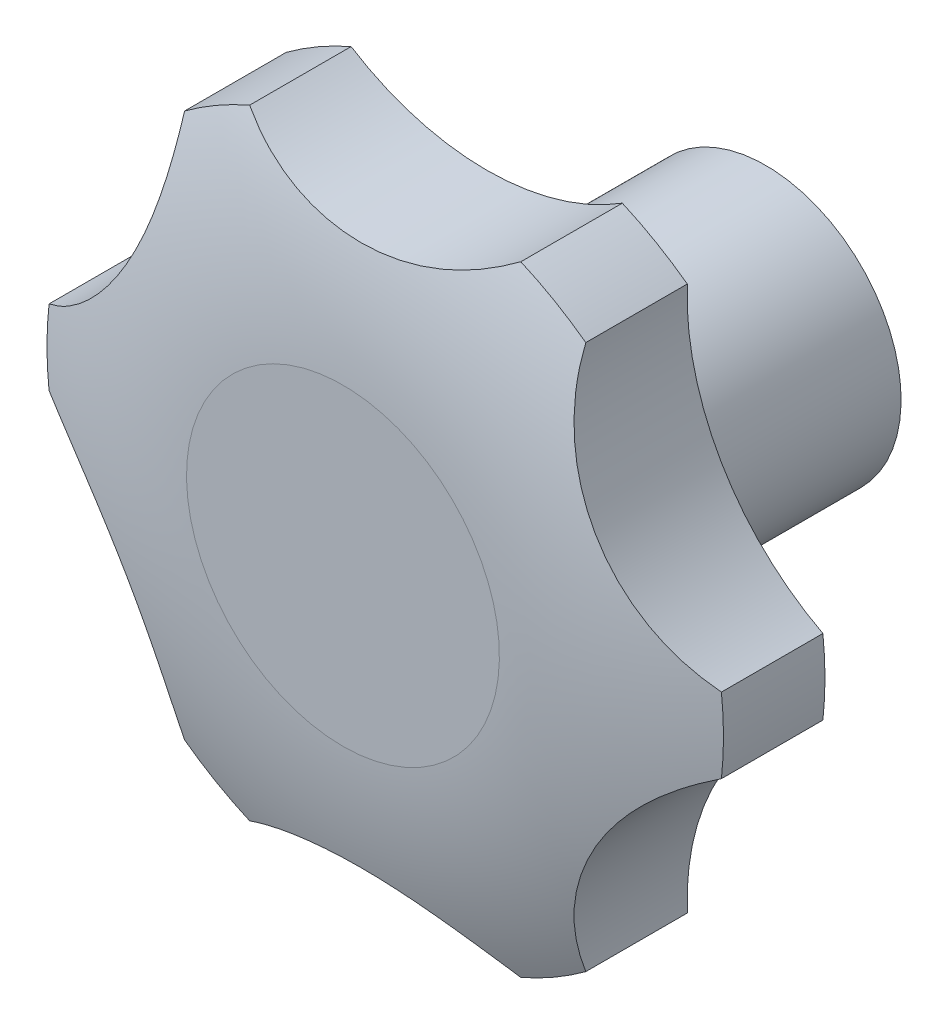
ISO-10303-21;
HEADER;
FILE_DESCRIPTION(('STEP AP214'),'2;1');
FILE_NAME('part.step','',(''),(''),'','','');
FILE_SCHEMA(('AUTOMOTIVE_DESIGN { 1 0 10303 214 1 1 1 1 }'));
ENDSEC;
DATA;
#1=APPLICATION_CONTEXT('core data for automotive mechanical design processes');
#2=APPLICATION_PROTOCOL_DEFINITION('international standard','automotive_design',2000,#1);
#3=PRODUCT_CONTEXT('',#1,'mechanical');
#4=PRODUCT('Part','Part','',(#3));
#5=PRODUCT_RELATED_PRODUCT_CATEGORY('part','',(#4));
#6=PRODUCT_DEFINITION_FORMATION('','',#4);
#7=PRODUCT_DEFINITION_CONTEXT('part definition',#1,'design');
#8=PRODUCT_DEFINITION('design','',#6,#7);
#9=PRODUCT_DEFINITION_SHAPE('','',#8);
#10=(LENGTH_UNIT() NAMED_UNIT(*) SI_UNIT(.MILLI.,.METRE.));
#11=(NAMED_UNIT(*) PLANE_ANGLE_UNIT() SI_UNIT($,.RADIAN.));
#12=(NAMED_UNIT(*) SI_UNIT($,.STERADIAN.) SOLID_ANGLE_UNIT());
#13=UNCERTAINTY_MEASURE_WITH_UNIT(LENGTH_MEASURE(1.E-05),#10,'distance_accuracy_value','');
#14=(GEOMETRIC_REPRESENTATION_CONTEXT(3) GLOBAL_UNCERTAINTY_ASSIGNED_CONTEXT((#13)) GLOBAL_UNIT_ASSIGNED_CONTEXT((#10,
#11,#12)) REPRESENTATION_CONTEXT('',''));
#15=CARTESIAN_POINT('',(0.,0.,0.));
#16=DIRECTION('',(0.,0.,1.));
#17=DIRECTION('',(1.,0.,0.));
#18=AXIS2_PLACEMENT_3D('',#15,#16,#17);
#19=CARTESIAN_POINT('',(0.,0.,0.));
#20=DIRECTION('',(0.,0.,1.));
#21=DIRECTION('',(0.,-1.,0.));
#22=AXIS2_PLACEMENT_3D('',#19,#20,#21);
#23=PLANE('',#22);
#24=CARTESIAN_POINT('',(0.,0.,0.));
#25=DIRECTION('',(0.,0.,-1.));
#26=DIRECTION('',(0.,1.,0.));
#27=AXIS2_PLACEMENT_3D('',#24,#25,#26);
#28=CIRCLE('',#27,2.5);
#29=CARTESIAN_POINT('',(0.,2.5,0.));
#30=VERTEX_POINT('',#29);
#31=EDGE_CURVE('E214',#30,#30,#28,.T.);
#32=ORIENTED_EDGE('',*,*,#31,.F.);
#33=EDGE_LOOP('',(#32));
#34=FACE_BOUND('',#33,.T.);
#35=CARTESIAN_POINT('',(0.,0.,0.));
#36=DIRECTION('',(0.,0.,1.));
#37=DIRECTION('',(0.,-1.,0.));
#38=AXIS2_PLACEMENT_3D('',#35,#36,#37);
#39=CIRCLE('',#38,16.);
#40=CARTESIAN_POINT('',(0.,-16.,0.));
#41=VERTEX_POINT('',#40);
#42=EDGE_CURVE('E158',#41,#41,#39,.T.);
#43=ORIENTED_EDGE('',*,*,#42,.F.);
#44=EDGE_LOOP('',(#43));
#45=FACE_BOUND('',#44,.T.);
#46=ADVANCED_FACE('F14',(#34,#45),#23,.F.);
#47=CARTESIAN_POINT('',(0.,0.,30.));
#48=DIRECTION('',(0.,0.,1.));
#49=DIRECTION('',(0.,-1.,0.));
#50=AXIS2_PLACEMENT_3D('',#47,#48,#49);
#51=CYLINDRICAL_SURFACE('',#50,16.);
#52=ORIENTED_EDGE('',*,*,#42,.T.);
#53=EDGE_LOOP('',(#52));
#54=FACE_BOUND('',#53,.T.);
#55=CARTESIAN_POINT('',(0.,0.,33.));
#56=DIRECTION('',(0.,0.,-1.));
#57=DIRECTION('',(-1.,0.,0.));
#58=AXIS2_PLACEMENT_3D('',#55,#56,#57);
#59=CIRCLE('',#58,16.);
#60=CARTESIAN_POINT('',(-16.,0.,33.));
#61=VERTEX_POINT('',#60);
#62=EDGE_CURVE('E112',#61,#61,#59,.T.);
#63=ORIENTED_EDGE('',*,*,#62,.T.);
#64=EDGE_LOOP('',(#63));
#65=FACE_BOUND('',#64,.T.);
#66=ADVANCED_FACE('F204',(#54,#65),#51,.T.);
#67=CARTESIAN_POINT('',(0.,0.,10.));
#68=DIRECTION('',(0.,0.,-1.));
#69=DIRECTION('',(0.,1.,0.));
#70=AXIS2_PLACEMENT_3D('',#67,#68,#69);
#71=CYLINDRICAL_SURFACE('',#70,2.5);
#72=ORIENTED_EDGE('',*,*,#31,.T.);
#73=EDGE_LOOP('',(#72));
#74=FACE_BOUND('',#73,.T.);
#75=CARTESIAN_POINT('',(0.,0.,30.));
#76=DIRECTION('',(0.,0.,-1.));
#77=DIRECTION('',(-1.,0.,0.));
#78=AXIS2_PLACEMENT_3D('',#75,#76,#77);
#79=CIRCLE('',#78,2.5);
#80=CARTESIAN_POINT('',(-2.5,0.,30.));
#81=VERTEX_POINT('',#80);
#82=EDGE_CURVE('E219',#81,#81,#79,.T.);
#83=ORIENTED_EDGE('',*,*,#82,.F.);
#84=EDGE_LOOP('',(#83));
#85=FACE_BOUND('',#84,.T.);
#86=ADVANCED_FACE('F200',(#74,#85),#71,.F.);
#87=CARTESIAN_POINT('',(26.8467875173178,15.4999999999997,33.));
#88=DIRECTION('',(0.,0.,-1.));
#89=DIRECTION('',(-1.,0.,0.));
#90=AXIS2_PLACEMENT_3D('',#87,#88,#89);
#91=PLANE('',#90);
#92=ORIENTED_EDGE('',*,*,#62,.F.);
#93=EDGE_LOOP('',(#92));
#94=FACE_BOUND('',#93,.T.);
#95=CARTESIAN_POINT('',(53.6935750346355,30.9999999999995,33.));
#96=DIRECTION('',(0.,0.,1.));
#97=DIRECTION('',(-1.,0.,0.));
#98=AXIS2_PLACEMENT_3D('',#95,#96,#97);
#99=CIRCLE('',#98,30.);
#100=CARTESIAN_POINT('',(23.7179702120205,32.2095931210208,33.));
#101=VERTEX_POINT('',#100);
#102=CARTESIAN_POINT('',(39.7533109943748,4.43556816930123,33.));
#103=VERTEX_POINT('',#102);
#104=EDGE_CURVE('E105',#101,#103,#99,.T.);
#105=ORIENTED_EDGE('',*,*,#104,.T.);
#106=CARTESIAN_POINT('',(0.,0.,33.));
#107=DIRECTION('',(0.,0.,-1.));
#108=DIRECTION('',(-1.,0.,0.));
#109=AXIS2_PLACEMENT_3D('',#106,#107,#108);
#110=CIRCLE('',#109,40.);
#111=CARTESIAN_POINT('',(39.7533109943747,-4.43556816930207,33.));
#112=VERTEX_POINT('',#111);
#113=EDGE_CURVE('E34',#103,#112,#110,.T.);
#114=ORIENTED_EDGE('',*,*,#113,.T.);
#115=CARTESIAN_POINT('',(53.6935750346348,-31.0000000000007,33.));
#116=DIRECTION('',(0.,0.,1.));
#117=DIRECTION('',(-1.,0.,0.));
#118=AXIS2_PLACEMENT_3D('',#115,#116,#117);
#119=CIRCLE('',#118,30.);
#120=CARTESIAN_POINT('',(23.7179702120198,-32.2095931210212,33.));
#121=VERTEX_POINT('',#120);
#122=EDGE_CURVE('E119',#112,#121,#119,.T.);
#123=ORIENTED_EDGE('',*,*,#122,.T.);
#124=CARTESIAN_POINT('',(0.,0.,33.));
#125=DIRECTION('',(0.,0.,-1.));
#126=DIRECTION('',(-1.,0.,0.));
#127=AXIS2_PLACEMENT_3D('',#124,#125,#126);
#128=CIRCLE('',#127,40.);
#129=CARTESIAN_POINT('',(16.0353407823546,-36.6451612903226,33.));
#130=VERTEX_POINT('',#129);
#131=EDGE_CURVE('E225',#121,#130,#128,.T.);
#132=ORIENTED_EDGE('',*,*,#131,.T.);
#133=CARTESIAN_POINT('',(0.,-62.,33.));
#134=DIRECTION('',(0.,0.,1.));
#135=DIRECTION('',(-1.,0.,0.));
#136=AXIS2_PLACEMENT_3D('',#133,#134,#135);
#137=CIRCLE('',#136,30.);
#138=CARTESIAN_POINT('',(-16.0353407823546,-36.6451612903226,33.));
#139=VERTEX_POINT('',#138);
#140=EDGE_CURVE('E227',#130,#139,#137,.T.);
#141=ORIENTED_EDGE('',*,*,#140,.T.);
#142=CARTESIAN_POINT('',(0.,0.,33.));
#143=DIRECTION('',(0.,0.,-1.));
#144=DIRECTION('',(-1.,0.,0.));
#145=AXIS2_PLACEMENT_3D('',#142,#143,#144);
#146=CIRCLE('',#145,40.);
#147=CARTESIAN_POINT('',(-23.7179702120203,-32.2095931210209,33.));
#148=VERTEX_POINT('',#147);
#149=EDGE_CURVE('E229',#139,#148,#146,.T.);
#150=ORIENTED_EDGE('',*,*,#149,.T.);
#151=CARTESIAN_POINT('',(-53.6935750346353,-31.,33.));
#152=DIRECTION('',(0.,0.,1.));
#153=DIRECTION('',(-1.,0.,0.));
#154=AXIS2_PLACEMENT_3D('',#151,#152,#153);
#155=CIRCLE('',#154,30.);
#156=CARTESIAN_POINT('',(-39.7533109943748,-4.43556816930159,33.));
#157=VERTEX_POINT('',#156);
#158=EDGE_CURVE('E231',#148,#157,#155,.T.);
#159=ORIENTED_EDGE('',*,*,#158,.T.);
#160=CARTESIAN_POINT('',(0.,0.,33.));
#161=DIRECTION('',(0.,0.,-1.));
#162=DIRECTION('',(-1.,0.,0.));
#163=AXIS2_PLACEMENT_3D('',#160,#161,#162);
#164=CIRCLE('',#163,40.);
#165=CARTESIAN_POINT('',(-39.7533109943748,4.43556816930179,33.));
#166=VERTEX_POINT('',#165);
#167=EDGE_CURVE('E233',#157,#166,#164,.T.);
#168=ORIENTED_EDGE('',*,*,#167,.T.);
#169=CARTESIAN_POINT('',(-53.6935750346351,31.,33.));
#170=DIRECTION('',(0.,0.,1.));
#171=DIRECTION('',(-1.,0.,0.));
#172=AXIS2_PLACEMENT_3D('',#169,#170,#171);
#173=CIRCLE('',#172,30.);
#174=CARTESIAN_POINT('',(-23.7179702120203,32.2095931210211,33.));
#175=VERTEX_POINT('',#174);
#176=EDGE_CURVE('E235',#166,#175,#173,.T.);
#177=ORIENTED_EDGE('',*,*,#176,.T.);
#178=CARTESIAN_POINT('',(0.,0.,33.));
#179=DIRECTION('',(0.,0.,-1.));
#180=DIRECTION('',(-1.,0.,0.));
#181=AXIS2_PLACEMENT_3D('',#178,#179,#180);
#182=CIRCLE('',#181,40.);
#183=CARTESIAN_POINT('',(-16.0353407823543,36.6451612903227,33.));
#184=VERTEX_POINT('',#183);
#185=EDGE_CURVE('E237',#175,#184,#182,.T.);
#186=ORIENTED_EDGE('',*,*,#185,.T.);
#187=CARTESIAN_POINT('',(4.32943936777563E-13,62.,33.));
#188=DIRECTION('',(0.,0.,1.));
#189=DIRECTION('',(-1.,0.,0.));
#190=AXIS2_PLACEMENT_3D('',#187,#188,#189);
#191=CIRCLE('',#190,30.);
#192=CARTESIAN_POINT('',(16.0353407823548,36.6451612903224,33.));
#193=VERTEX_POINT('',#192);
#194=EDGE_CURVE('E239',#184,#193,#191,.T.);
#195=ORIENTED_EDGE('',*,*,#194,.T.);
#196=CARTESIAN_POINT('',(0.,0.,33.));
#197=DIRECTION('',(0.,0.,-1.));
#198=DIRECTION('',(-1.,0.,0.));
#199=AXIS2_PLACEMENT_3D('',#196,#197,#198);
#200=CIRCLE('',#199,40.);
#201=EDGE_CURVE('E108',#193,#101,#200,.T.);
#202=ORIENTED_EDGE('',*,*,#201,.T.);
#203=EDGE_LOOP('',(#105,#114,#123,#132,#141,#150,#159,#168,#177,#186,#195,#202));
#204=FACE_BOUND('',#203,.T.);
#205=ADVANCED_FACE('F106',(#94,#204),#91,.T.);
#206=CARTESIAN_POINT('',(0.,0.,50.));
#207=DIRECTION('',(0.,0.,1.));
#208=DIRECTION('',(0.,-1.,0.));
#209=AXIS2_PLACEMENT_3D('',#206,#207,#208);
#210=PLANE('',#209);
#211=CARTESIAN_POINT('',(0.,0.,50.));
#212=DIRECTION('',(0.,0.,1.));
#213=DIRECTION('',(0.,-1.,0.));
#214=AXIS2_PLACEMENT_3D('',#211,#212,#213);
#215=CIRCLE('',#214,18.5);
#216=CARTESIAN_POINT('',(0.,-18.5,50.));
#217=VERTEX_POINT('',#216);
#218=EDGE_CURVE('E151',#217,#217,#215,.T.);
#219=ORIENTED_EDGE('',*,*,#218,.T.);
#220=EDGE_LOOP('',(#219));
#221=FACE_BOUND('',#220,.T.);
#222=ADVANCED_FACE('F190',(#221),#210,.T.);
#223=CARTESIAN_POINT('',(0.,0.,-9.94325367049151));
#224=DIRECTION('',(0.,0.,1.));
#225=DIRECTION('',(0.,-1.,0.));
#226=AXIS2_PLACEMENT_3D('',#223,#224,#225);
#227=DEGENERATE_TOROIDAL_SURFACE('',#226,15.8911037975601,60.,.T.);
#228=ORIENTED_EDGE('',*,*,#218,.F.);
#229=EDGE_LOOP('',(#228));
#230=FACE_BOUND('',#229,.T.);
#231=CARTESIAN_POINT('',(0.,0.,45.));
#232=DIRECTION('',(0.,0.,1.));
#233=DIRECTION('',(0.,-1.,0.));
#234=AXIS2_PLACEMENT_3D('',#231,#232,#233);
#235=CIRCLE('',#234,40.);
#236=CARTESIAN_POINT('',(16.0353407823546,-36.6451612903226,45.));
#237=VERTEX_POINT('',#236);
#238=CARTESIAN_POINT('',(23.7179702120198,-32.2095931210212,45.));
#239=VERTEX_POINT('',#238);
#240=EDGE_CURVE('E155',#237,#239,#235,.T.);
#241=ORIENTED_EDGE('',*,*,#240,.T.);
#242=CARTESIAN_POINT('',(23.7179923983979,-32.2101428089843,44.9998));
#243=CARTESIAN_POINT('',(23.7039256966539,-31.8618866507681,45.1265211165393));
#244=CARTESIAN_POINT('',(23.6958796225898,-31.5118252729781,45.2489596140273));
#245=CARTESIAN_POINT('',(23.6921267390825,-30.8087279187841,45.4852178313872));
#246=CARTESIAN_POINT('',(23.696420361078,-30.4556918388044,45.5990372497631));
#247=CARTESIAN_POINT('',(23.7176467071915,-29.7472785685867,45.8180031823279));
#248=CARTESIAN_POINT('',(23.7345803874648,-29.3919012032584,45.9231490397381));
#249=CARTESIAN_POINT('',(23.781319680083,-28.6795592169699,46.1247391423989));
#250=CARTESIAN_POINT('',(23.8111251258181,-28.3225946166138,46.2211835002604));
#251=CARTESIAN_POINT('',(23.9201113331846,-27.250885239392,46.4973517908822));
#252=CARTESIAN_POINT('',(24.0188815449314,-26.5346410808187,46.6641214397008));
#253=CARTESIAN_POINT('',(24.2696024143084,-25.1044871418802,46.9635443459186));
#254=CARTESIAN_POINT('',(24.4215492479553,-24.3905771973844,47.0962000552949));
#255=CARTESIAN_POINT('',(24.7789270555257,-22.970058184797,47.3286138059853));
#256=CARTESIAN_POINT('',(24.9844095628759,-22.2634568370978,47.4283399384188));
#257=CARTESIAN_POINT('',(25.4481635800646,-20.8639130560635,47.5959824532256));
#258=CARTESIAN_POINT('',(25.7064376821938,-20.1709712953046,47.6638972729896));
#259=CARTESIAN_POINT('',(26.2743657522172,-18.804329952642,47.769073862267));
#260=CARTESIAN_POINT('',(26.5840042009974,-18.1306246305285,47.8063448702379));
#261=CARTESIAN_POINT('',(27.2527858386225,-16.8072442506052,47.8510442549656));
#262=CARTESIAN_POINT('',(27.6119280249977,-16.1575687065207,47.8584732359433));
#263=CARTESIAN_POINT('',(28.375697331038,-14.8894206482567,47.8436874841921));
#264=CARTESIAN_POINT('',(28.7801369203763,-14.270833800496,47.82159111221));
#265=CARTESIAN_POINT('',(29.6326427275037,-13.0663468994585,47.7474785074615));
#266=CARTESIAN_POINT('',(30.0807100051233,-12.4804476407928,47.6954615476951));
#267=CARTESIAN_POINT('',(31.0169116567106,-11.3452211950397,47.560503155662));
#268=CARTESIAN_POINT('',(31.5050520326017,-10.7958995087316,47.4775570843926));
#269=CARTESIAN_POINT('',(32.5170837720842,-9.7375412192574,47.2794985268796));
#270=CARTESIAN_POINT('',(33.0409709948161,-9.22849996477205,47.1643897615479));
#271=CARTESIAN_POINT('',(34.0564715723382,-8.31088050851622,46.9162808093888));
#272=CARTESIAN_POINT('',(34.5446742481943,-7.89751955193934,46.7869571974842));
#273=CARTESIAN_POINT('',(35.5415904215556,-7.10626838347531,46.5017312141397));
#274=CARTESIAN_POINT('',(36.0503031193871,-6.72837679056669,46.3458298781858));
#275=CARTESIAN_POINT('',(37.0843697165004,-6.00938814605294,46.0071639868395));
#276=CARTESIAN_POINT('',(37.6097195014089,-5.66828208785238,45.8244060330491));
#277=CARTESIAN_POINT('',(38.4072533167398,-5.18478859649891,45.5301980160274));
#278=CARTESIAN_POINT('',(38.674706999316,-5.0283056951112,45.4287735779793));
#279=CARTESIAN_POINT('',(39.2123262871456,-4.72475075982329,45.2192703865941));
#280=CARTESIAN_POINT('',(39.4824918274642,-4.57767850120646,45.1111917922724));
#281=CARTESIAN_POINT('',(39.7537981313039,-4.43531253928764,44.9998));
#282=B_SPLINE_CURVE_WITH_KNOTS('',3,(#242,#243,#244,#245,#246,#247,#248,#249,#250,#251,#252,
#253,#254,#255,#256,#257,#258,#259,#260,#261,#262,#263,#264,#265,#266,#267,#268,#269,#270,#271,
#272,#273,#274,#275,#276,#277,#278,#279,#280,#281),.UNSPECIFIED.,.F.,.F.,(4,2,2,2,2,2,2,2,2,2,2,
2,2,2,2,2,2,2,2,4),(0.,1.11251118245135,2.22506126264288,3.33769551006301,4.45031535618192,
6.67341469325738,8.89635419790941,11.1214414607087,13.3466380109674,15.5711634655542,
17.7956438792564,20.0112335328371,22.2268770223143,24.4428529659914,26.6585726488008,
28.6146798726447,30.5707109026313,32.5262619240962,33.5042114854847,34.4821376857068),.UNSPECIFIED.);
#283=CARTESIAN_POINT('',(39.7533109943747,-4.43556816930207,45.));
#284=VERTEX_POINT('',#283);
#285=EDGE_CURVE('E9',#239,#284,#282,.T.);
#286=ORIENTED_EDGE('',*,*,#285,.T.);
#287=CARTESIAN_POINT('',(39.7533109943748,4.43556816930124,45.));
#288=VERTEX_POINT('',#287);
#289=EDGE_CURVE('E159',#284,#288,#235,.T.);
#290=ORIENTED_EDGE('',*,*,#289,.T.);
#291=CARTESIAN_POINT('',(39.753798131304,4.4353125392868,44.9998));
#292=CARTESIAN_POINT('',(39.4451661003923,4.59725849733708,45.1265211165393));
#293=CARTESIAN_POINT('',(39.1379810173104,4.76532108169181,45.2489596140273));
#294=CARTESIAN_POINT('',(38.5272044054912,5.11361966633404,45.4852178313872));
#295=CARTESIAN_POINT('',(38.223613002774,5.29385609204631,45.5990372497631));
#296=CARTESIAN_POINT('',(37.6207222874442,5.66644528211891,45.8180031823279));
#297=CARTESIAN_POINT('',(37.3214233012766,5.85879896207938,45.9231490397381));
#298=CARTESIAN_POINT('',(36.7278866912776,6.2554473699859,46.1247391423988));
#299=CARTESIAN_POINT('',(36.433649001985,6.45974194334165,46.2211835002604));
#300=CARTESIAN_POINT('',(35.5600145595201,7.08998145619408,46.4973517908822));
#301=CARTESIAN_POINT('',(34.9891140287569,7.53364104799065,46.6641214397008));
#302=CARTESIAN_POINT('',(33.8759248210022,8.46584865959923,46.9635443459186));
#303=CARTESIAN_POINT('',(33.3336340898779,8.95439344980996,47.0962000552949));
#304=CARTESIAN_POINT('',(32.2821174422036,9.97415121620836,47.3286138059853));
#305=CARTESIAN_POINT('',(31.772923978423,10.5054049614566,47.4283399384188));
#306=CARTESIAN_POINT('',(30.7927605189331,11.6067996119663,47.5959824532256));
#307=CARTESIAN_POINT('',(30.3217924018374,12.1769424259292,47.6638972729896));
#308=CARTESIAN_POINT('',(29.4222103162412,13.352103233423,47.769073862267));
#309=CARTESIAN_POINT('',(28.9935836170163,13.9571106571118,47.8063448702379));
#310=CARTESIAN_POINT('',(28.1818934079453,15.1979827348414,47.8510442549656));
#311=CARTESIAN_POINT('',(27.7988289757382,15.8338467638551,47.8584732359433));
#312=CARTESIAN_POINT('',(27.0824651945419,17.1293644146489,47.8436874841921));
#313=CARTESIAN_POINT('',(26.7489730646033,17.7889127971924,47.82159111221));
#314=CARTESIAN_POINT('',(26.1321097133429,19.1294479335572,47.7474785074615));
#315=CARTESIAN_POINT('',(25.8487397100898,19.8104352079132,47.6954615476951));
#316=CARTESIAN_POINT('',(25.3337055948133,21.1888228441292,47.560503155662));
#317=CARTESIAN_POINT('',(25.1020492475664,21.8862256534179,47.4775570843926));
#318=CARTESIAN_POINT('',(24.6914999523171,23.291849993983,47.2794985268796));
#319=CARTESIAN_POINT('',(24.5126009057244,24.0000702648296,47.1643897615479));
#320=CARTESIAN_POINT('',(24.2256694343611,25.3383292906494,46.9162808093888));
#321=CARTESIAN_POINT('',(24.1117896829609,25.9678056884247,46.7869571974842));
#322=CARTESIAN_POINT('',(23.9250041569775,27.2267860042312,46.5017312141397));
#323=CARTESIAN_POINT('',(23.8520967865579,27.8562899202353,46.3458298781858));
#324=CARTESIAN_POINT('',(23.7464676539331,29.1113121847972,46.0071639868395));
#325=CARTESIAN_POINT('',(23.7137360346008,29.736831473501,45.8244060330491));
#326=CARTESIAN_POINT('',(23.6937852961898,30.6692627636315,45.5301980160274));
#327=CARTESIAN_POINT('',(23.6919939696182,30.979125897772,45.4287735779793));
#328=CARTESIAN_POINT('',(23.6979173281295,31.5964953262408,45.219270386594));
#329=CARTESIAN_POINT('',(23.7056317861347,31.9040016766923,45.1111917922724));
#330=CARTESIAN_POINT('',(23.7179923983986,32.2101428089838,44.9998));
#331=B_SPLINE_CURVE_WITH_KNOTS('',3,(#291,#292,#293,#294,#295,#296,#297,#298,#299,#300,#301,
#302,#303,#304,#305,#306,#307,#308,#309,#310,#311,#312,#313,#314,#315,#316,#317,#318,#319,#320,
#321,#322,#323,#324,#325,#326,#327,#328,#329,#330),.UNSPECIFIED.,.F.,.F.,(4,2,2,2,2,2,2,2,2,2,2,
2,2,2,2,2,2,2,2,4),(0.,1.11251118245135,2.22506126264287,3.337695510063,4.45031535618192,
6.67341469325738,8.89635419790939,11.1214414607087,13.3466380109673,15.5711634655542,
17.7956438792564,20.0112335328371,22.2268770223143,24.4428529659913,26.6585726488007,
28.6146798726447,30.5707109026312,32.5262619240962,33.5042114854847,34.4821376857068),.UNSPECIFIED.);
#332=CARTESIAN_POINT('',(23.7179702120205,32.2095931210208,45.));
#333=VERTEX_POINT('',#332);
#334=EDGE_CURVE('E27',#288,#333,#331,.T.);
#335=ORIENTED_EDGE('',*,*,#334,.T.);
#336=CARTESIAN_POINT('',(16.0353407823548,36.6451612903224,45.));
#337=VERTEX_POINT('',#336);
#338=EDGE_CURVE('E291',#333,#337,#235,.T.);
#339=ORIENTED_EDGE('',*,*,#338,.T.);
#340=CARTESIAN_POINT('',(16.0358057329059,36.645455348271,44.9998));
#341=CARTESIAN_POINT('',(15.7412404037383,36.4591451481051,45.1265211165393));
#342=CARTESIAN_POINT('',(15.4421013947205,36.2771463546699,45.2489596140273));
#343=CARTESIAN_POINT('',(14.8350776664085,35.9223475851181,45.4852178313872));
#344=CARTESIAN_POINT('',(14.5271926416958,35.7495479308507,45.5990372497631));
#345=CARTESIAN_POINT('',(13.9030755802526,35.4137238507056,45.8180031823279));
#346=CARTESIAN_POINT('',(13.5868429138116,35.2507001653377,45.9231490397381));
#347=CARTESIAN_POINT('',(12.9465670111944,34.9350065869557,46.1247391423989));
#348=CARTESIAN_POINT('',(12.6225238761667,34.7823365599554,46.2211835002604));
#349=CARTESIAN_POINT('',(11.6399032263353,34.340866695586,46.4973517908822));
#350=CARTESIAN_POINT('',(10.9702324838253,34.0682821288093,46.6641214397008));
#351=CARTESIAN_POINT('',(9.60632240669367,33.5703358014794,46.9635443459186));
#352=CARTESIAN_POINT('',(8.91208484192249,33.3449706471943,47.0962000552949));
#353=CARTESIAN_POINT('',(7.50319038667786,32.9442094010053,47.3286138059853));
#354=CARTESIAN_POINT('',(6.78851441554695,32.7688617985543,47.4283399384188));
#355=CARTESIAN_POINT('',(5.34459693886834,32.4707126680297,47.5959824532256));
#356=CARTESIAN_POINT('',(4.61535471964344,32.3479137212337,47.6638972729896));
#357=CARTESIAN_POINT('',(3.14784456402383,32.1564331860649,47.769073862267));
#358=CARTESIAN_POINT('',(2.40957941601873,32.0877352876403,47.8063448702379));
#359=CARTESIAN_POINT('',(0.929107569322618,32.0052269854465,47.8510442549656));
#360=CARTESIAN_POINT('',(0.186900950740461,31.9914154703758,47.8584732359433));
#361=CARTESIAN_POINT('',(-1.29323213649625,32.0187850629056,47.8436874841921));
#362=CARTESIAN_POINT('',(-2.03116385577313,32.0597465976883,47.82159111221));
#363=CARTESIAN_POINT('',(-3.50053301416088,32.1957948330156,47.7474785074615));
#364=CARTESIAN_POINT('',(-4.23197029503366,32.290882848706,47.6954615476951));
#365=CARTESIAN_POINT('',(-5.68320606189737,32.5340440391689,47.560503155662));
#366=CARTESIAN_POINT('',(-6.40300278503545,32.6821251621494,47.4775570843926));
#367=CARTESIAN_POINT('',(-7.82558381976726,33.0293912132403,47.2794985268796));
#368=CARTESIAN_POINT('',(-8.52837008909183,33.2285702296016,47.1643897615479));
#369=CARTESIAN_POINT('',(-9.8308021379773,33.6492097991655,46.9162808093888));
#370=CARTESIAN_POINT('',(-10.4328845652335,33.865325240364,46.7869571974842));
#371=CARTESIAN_POINT('',(-11.6165862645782,34.3330543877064,46.5017312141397));
#372=CARTESIAN_POINT('',(-12.1982063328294,34.5846667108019,46.3458298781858));
#373=CARTESIAN_POINT('',(-13.3379020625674,35.1207003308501,46.0071639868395));
#374=CARTESIAN_POINT('',(-13.8959834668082,35.4051135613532,45.8244060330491));
#375=CARTESIAN_POINT('',(-14.7134680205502,35.8540513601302,45.5301980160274));
#376=CARTESIAN_POINT('',(-14.9827130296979,36.007431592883,45.4287735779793));
#377=CARTESIAN_POINT('',(-15.5144089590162,36.321246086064,45.2192703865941));
#378=CARTESIAN_POINT('',(-15.7768600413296,36.4816801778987,45.1111917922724));
#379=CARTESIAN_POINT('',(-16.0358057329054,36.6454553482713,44.9998));
#380=B_SPLINE_CURVE_WITH_KNOTS('',3,(#340,#341,#342,#343,#344,#345,#346,#347,#348,#349,#350,
#351,#352,#353,#354,#355,#356,#357,#358,#359,#360,#361,#362,#363,#364,#365,#366,#367,#368,#369,
#370,#371,#372,#373,#374,#375,#376,#377,#378,#379),.UNSPECIFIED.,.F.,.F.,(4,2,2,2,2,2,2,2,2,2,2,
2,2,2,2,2,2,2,2,4),(0.,1.11251118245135,2.22506126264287,3.33769551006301,4.45031535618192,
6.67341469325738,8.8963541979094,11.1214414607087,13.3466380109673,15.5711634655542,
17.7956438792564,20.0112335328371,22.2268770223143,24.4428529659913,26.6585726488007,
28.6146798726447,30.5707109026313,32.5262619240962,33.5042114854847,34.4821376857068),.UNSPECIFIED.);
#381=CARTESIAN_POINT('',(-16.0353407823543,36.6451612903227,45.));
#382=VERTEX_POINT('',#381);
#383=EDGE_CURVE('E287',#337,#382,#380,.T.);
#384=ORIENTED_EDGE('',*,*,#383,.T.);
#385=CARTESIAN_POINT('',(-23.7179702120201,32.2095931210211,45.));
#386=VERTEX_POINT('',#385);
#387=EDGE_CURVE('E280',#382,#386,#235,.T.);
#388=ORIENTED_EDGE('',*,*,#387,.T.);
#389=CARTESIAN_POINT('',(-23.7179923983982,32.2101428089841,44.9998));
#390=CARTESIAN_POINT('',(-23.7039256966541,31.8618866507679,45.1265211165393));
#391=CARTESIAN_POINT('',(-23.6958796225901,31.5118252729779,45.2489596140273));
#392=CARTESIAN_POINT('',(-23.6921267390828,30.808727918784,45.4852178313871));
#393=CARTESIAN_POINT('',(-23.6964203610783,30.4556918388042,45.5990372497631));
#394=CARTESIAN_POINT('',(-23.7176467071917,29.7472785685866,45.8180031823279));
#395=CARTESIAN_POINT('',(-23.7345803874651,29.3919012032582,45.9231490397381));
#396=CARTESIAN_POINT('',(-23.7813196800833,28.6795592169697,46.1247391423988));
#397=CARTESIAN_POINT('',(-23.8111251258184,28.3225946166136,46.2211835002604));
#398=CARTESIAN_POINT('',(-23.9201113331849,27.2508852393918,46.4973517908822));
#399=CARTESIAN_POINT('',(-24.0188815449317,26.5346410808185,46.6641214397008));
#400=CARTESIAN_POINT('',(-24.2696024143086,25.10448714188,46.9635443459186));
#401=CARTESIAN_POINT('',(-24.4215492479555,24.3905771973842,47.0962000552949));
#402=CARTESIAN_POINT('',(-24.7789270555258,22.9700581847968,47.3286138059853));
#403=CARTESIAN_POINT('',(-24.984409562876,22.2634568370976,47.4283399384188));
#404=CARTESIAN_POINT('',(-25.4481635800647,20.8639130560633,47.5959824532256));
#405=CARTESIAN_POINT('',(-25.7064376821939,20.1709712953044,47.6638972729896));
#406=CARTESIAN_POINT('',(-26.2743657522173,18.8043299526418,47.769073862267));
#407=CARTESIAN_POINT('',(-26.5840042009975,18.1306246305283,47.8063448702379));
#408=CARTESIAN_POINT('',(-27.2527858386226,16.807244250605,47.8510442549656));
#409=CARTESIAN_POINT('',(-27.6119280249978,16.1575687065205,47.8584732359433));
#410=CARTESIAN_POINT('',(-28.3756973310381,14.8894206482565,47.8436874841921));
#411=CARTESIAN_POINT('',(-28.7801369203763,14.2708338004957,47.82159111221));
#412=CARTESIAN_POINT('',(-29.6326427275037,13.0663468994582,47.7474785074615));
#413=CARTESIAN_POINT('',(-30.0807100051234,12.4804476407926,47.6954615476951));
#414=CARTESIAN_POINT('',(-31.0169116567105,11.3452211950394,47.560503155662));
#415=CARTESIAN_POINT('',(-31.5050520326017,10.7958995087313,47.4775570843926));
#416=CARTESIAN_POINT('',(-32.5170837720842,9.73754121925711,47.2794985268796));
#417=CARTESIAN_POINT('',(-33.0409709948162,9.22849996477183,47.1643897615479));
#418=CARTESIAN_POINT('',(-34.0564715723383,8.31088050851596,46.9162808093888));
#419=CARTESIAN_POINT('',(-34.5446742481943,7.89751955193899,46.7869571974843));
#420=CARTESIAN_POINT('',(-35.5415904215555,7.10626838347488,46.5017312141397));
#421=CARTESIAN_POINT('',(-36.0503031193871,6.72837679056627,46.3458298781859));
#422=CARTESIAN_POINT('',(-37.0843697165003,6.00938814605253,46.0071639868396));
#423=CARTESIAN_POINT('',(-37.6097195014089,5.66828208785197,45.8244060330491));
#424=CARTESIAN_POINT('',(-38.4072533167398,5.18478859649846,45.5301980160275));
#425=CARTESIAN_POINT('',(-38.6747069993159,5.02830569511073,45.4287735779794));
#426=CARTESIAN_POINT('',(-39.2123262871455,4.72475075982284,45.2192703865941));
#427=CARTESIAN_POINT('',(-39.4824918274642,4.57767850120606,45.1111917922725));
#428=CARTESIAN_POINT('',(-39.753798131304,4.43531253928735,44.9998));
#429=B_SPLINE_CURVE_WITH_KNOTS('',3,(#389,#390,#391,#392,#393,#394,#395,#396,#397,#398,#399,
#400,#401,#402,#403,#404,#405,#406,#407,#408,#409,#410,#411,#412,#413,#414,#415,#416,#417,#418,
#419,#420,#421,#422,#423,#424,#425,#426,#427,#428),.UNSPECIFIED.,.F.,.F.,(4,2,2,2,2,2,2,2,2,2,2,
2,2,2,2,2,2,2,2,4),(0.,1.11251118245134,2.22506126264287,3.337695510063,4.45031535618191,
6.67341469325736,8.89635419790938,11.1214414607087,13.3466380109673,15.5711634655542,
17.7956438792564,20.0112335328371,22.2268770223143,24.4428529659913,26.6585726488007,
28.6146798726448,30.5707109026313,32.5262619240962,33.5042114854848,34.4821376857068),.UNSPECIFIED.);
#430=CARTESIAN_POINT('',(-39.7533109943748,4.43556816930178,45.));
#431=VERTEX_POINT('',#430);
#432=EDGE_CURVE('E275',#386,#431,#429,.T.);
#433=ORIENTED_EDGE('',*,*,#432,.T.);
#434=CARTESIAN_POINT('',(-39.7533109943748,-4.43556816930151,45.));
#435=VERTEX_POINT('',#434);
#436=EDGE_CURVE('E267',#431,#435,#235,.T.);
#437=ORIENTED_EDGE('',*,*,#436,.T.);
#438=CARTESIAN_POINT('',(-39.753798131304,-4.43531253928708,44.9998));
#439=CARTESIAN_POINT('',(-39.4451661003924,-4.59725849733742,45.1265211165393));
#440=CARTESIAN_POINT('',(-39.1379810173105,-4.76532108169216,45.2489596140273));
#441=CARTESIAN_POINT('',(-38.5272044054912,-5.11361966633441,45.4852178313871));
#442=CARTESIAN_POINT('',(-38.2236130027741,-5.29385609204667,45.5990372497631));
#443=CARTESIAN_POINT('',(-37.6207222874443,-5.66644528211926,45.8180031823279));
#444=CARTESIAN_POINT('',(-37.3214233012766,-5.85879896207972,45.9231490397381));
#445=CARTESIAN_POINT('',(-36.7278866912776,-6.25544736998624,46.1247391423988));
#446=CARTESIAN_POINT('',(-36.433649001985,-6.45974194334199,46.2211835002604));
#447=CARTESIAN_POINT('',(-35.5600145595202,-7.08998145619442,46.4973517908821));
#448=CARTESIAN_POINT('',(-34.9891140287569,-7.53364104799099,46.6641214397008));
#449=CARTESIAN_POINT('',(-33.8759248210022,-8.46584865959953,46.9635443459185));
#450=CARTESIAN_POINT('',(-33.3336340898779,-8.9543934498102,47.0962000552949));
#451=CARTESIAN_POINT('',(-32.2821174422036,-9.97415121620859,47.3286138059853));
#452=CARTESIAN_POINT('',(-31.772923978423,-10.5054049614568,47.4283399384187));
#453=CARTESIAN_POINT('',(-30.7927605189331,-11.6067996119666,47.5959824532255));
#454=CARTESIAN_POINT('',(-30.3217924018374,-12.1769424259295,47.6638972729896));
#455=CARTESIAN_POINT('',(-29.4222103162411,-13.3521032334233,47.769073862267));
#456=CARTESIAN_POINT('',(-28.9935836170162,-13.9571106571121,47.8063448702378));
#457=CARTESIAN_POINT('',(-28.1818934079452,-15.1979827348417,47.8510442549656));
#458=CARTESIAN_POINT('',(-27.7988289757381,-15.8338467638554,47.8584732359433));
#459=CARTESIAN_POINT('',(-27.0824651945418,-17.1293644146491,47.8436874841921));
#460=CARTESIAN_POINT('',(-26.7489730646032,-17.7889127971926,47.82159111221));
#461=CARTESIAN_POINT('',(-26.1321097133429,-19.1294479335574,47.7474785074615));
#462=CARTESIAN_POINT('',(-25.8487397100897,-19.8104352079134,47.6954615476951));
#463=CARTESIAN_POINT('',(-25.3337055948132,-21.1888228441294,47.560503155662));
#464=CARTESIAN_POINT('',(-25.1020492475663,-21.8862256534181,47.4775570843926));
#465=CARTESIAN_POINT('',(-24.691499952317,-23.2918499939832,47.2794985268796));
#466=CARTESIAN_POINT('',(-24.5126009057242,-24.0000702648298,47.1643897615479));
#467=CARTESIAN_POINT('',(-24.2256694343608,-25.3383292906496,46.9162808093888));
#468=CARTESIAN_POINT('',(-24.1117896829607,-25.9678056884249,46.7869571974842));
#469=CARTESIAN_POINT('',(-23.9250041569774,-27.2267860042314,46.5017312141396));
#470=CARTESIAN_POINT('',(-23.8520967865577,-27.8562899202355,46.3458298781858));
#471=CARTESIAN_POINT('',(-23.7464676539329,-29.1113121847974,46.0071639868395));
#472=CARTESIAN_POINT('',(-23.7137360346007,-29.7368314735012,45.8244060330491));
#473=CARTESIAN_POINT('',(-23.6937852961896,-30.6692627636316,45.5301980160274));
#474=CARTESIAN_POINT('',(-23.691993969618,-30.9791258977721,45.4287735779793));
#475=CARTESIAN_POINT('',(-23.6979173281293,-31.596495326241,45.219270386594));
#476=CARTESIAN_POINT('',(-23.7056317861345,-31.9040016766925,45.1111917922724));
#477=CARTESIAN_POINT('',(-23.7179923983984,-32.210142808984,44.9998));
#478=B_SPLINE_CURVE_WITH_KNOTS('',3,(#438,#439,#440,#441,#442,#443,#444,#445,#446,#447,#448,
#449,#450,#451,#452,#453,#454,#455,#456,#457,#458,#459,#460,#461,#462,#463,#464,#465,#466,#467,
#468,#469,#470,#471,#472,#473,#474,#475,#476,#477),.UNSPECIFIED.,.F.,.F.,(4,2,2,2,2,2,2,2,2,2,2,
2,2,2,2,2,2,2,2,4),(0.,1.11251118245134,2.22506126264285,3.33769551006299,4.4503153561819,
6.67341469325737,8.89635419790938,11.1214414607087,13.3466380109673,15.5711634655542,
17.7956438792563,20.011233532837,22.2268770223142,24.4428529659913,26.6585726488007,
28.6146798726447,30.5707109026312,32.5262619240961,33.5042114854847,34.4821376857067),.UNSPECIFIED.);
#479=CARTESIAN_POINT('',(-23.7179702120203,-32.2095931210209,45.));
#480=VERTEX_POINT('',#479);
#481=EDGE_CURVE('E170',#435,#480,#478,.T.);
#482=ORIENTED_EDGE('',*,*,#481,.T.);
#483=CARTESIAN_POINT('',(-16.0353407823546,-36.6451612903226,45.));
#484=VERTEX_POINT('',#483);
#485=EDGE_CURVE('E154',#480,#484,#235,.T.);
#486=ORIENTED_EDGE('',*,*,#485,.T.);
#487=CARTESIAN_POINT('',(-16.0358057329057,-36.6454553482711,44.9998));
#488=CARTESIAN_POINT('',(-15.7412404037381,-36.4591451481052,45.1265211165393));
#489=CARTESIAN_POINT('',(-15.4421013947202,-36.27714635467,45.2489596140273));
#490=CARTESIAN_POINT('',(-14.8350776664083,-35.9223475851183,45.4852178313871));
#491=CARTESIAN_POINT('',(-14.5271926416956,-35.7495479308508,45.5990372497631));
#492=CARTESIAN_POINT('',(-13.9030755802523,-35.4137238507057,45.8180031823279));
#493=CARTESIAN_POINT('',(-13.5868429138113,-35.2507001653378,45.9231490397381));
#494=CARTESIAN_POINT('',(-12.9465670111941,-34.9350065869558,46.1247391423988));
#495=CARTESIAN_POINT('',(-12.6225238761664,-34.7823365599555,46.2211835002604));
#496=CARTESIAN_POINT('',(-11.6399032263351,-34.3408666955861,46.4973517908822));
#497=CARTESIAN_POINT('',(-10.970232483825,-34.0682821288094,46.6641214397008));
#498=CARTESIAN_POINT('',(-9.60632240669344,-33.5703358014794,46.9635443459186));
#499=CARTESIAN_POINT('',(-8.91208484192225,-33.3449706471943,47.0962000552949));
#500=CARTESIAN_POINT('',(-7.50319038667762,-32.9442094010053,47.3286138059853));
#501=CARTESIAN_POINT('',(-6.78851441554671,-32.7688617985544,47.4283399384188));
#502=CARTESIAN_POINT('',(-5.3445969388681,-32.4707126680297,47.5959824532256));
#503=CARTESIAN_POINT('',(-4.6153547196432,-32.3479137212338,47.6638972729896));
#504=CARTESIAN_POINT('',(-3.14784456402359,-32.156433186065,47.769073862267));
#505=CARTESIAN_POINT('',(-2.4095794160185,-32.0877352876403,47.8063448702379));
#506=CARTESIAN_POINT('',(-0.929107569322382,-32.0052269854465,47.8510442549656));
#507=CARTESIAN_POINT('',(-0.186900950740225,-31.9914154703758,47.8584732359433));
#508=CARTESIAN_POINT('',(1.29323213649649,-32.0187850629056,47.8436874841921));
#509=CARTESIAN_POINT('',(2.03116385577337,-32.0597465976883,47.82159111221));
#510=CARTESIAN_POINT('',(3.50053301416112,-32.1957948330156,47.7474785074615));
#511=CARTESIAN_POINT('',(4.2319702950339,-32.2908828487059,47.6954615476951));
#512=CARTESIAN_POINT('',(5.68320606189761,-32.5340440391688,47.560503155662));
#513=CARTESIAN_POINT('',(6.40300278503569,-32.6821251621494,47.4775570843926));
#514=CARTESIAN_POINT('',(7.82558381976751,-33.0293912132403,47.2794985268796));
#515=CARTESIAN_POINT('',(8.52837008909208,-33.2285702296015,47.1643897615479));
#516=CARTESIAN_POINT('',(9.83080213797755,-33.6492097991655,46.9162808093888));
#517=CARTESIAN_POINT('',(10.4328845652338,-33.8653252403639,46.7869571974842));
#518=CARTESIAN_POINT('',(11.6165862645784,-34.3330543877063,46.5017312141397));
#519=CARTESIAN_POINT('',(12.1982063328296,-34.5846667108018,46.3458298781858));
#520=CARTESIAN_POINT('',(13.3379020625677,-35.12070033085,46.0071639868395));
#521=CARTESIAN_POINT('',(13.8959834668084,-35.4051135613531,45.8244060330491));
#522=CARTESIAN_POINT('',(14.7134680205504,-35.8540513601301,45.5301980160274));
#523=CARTESIAN_POINT('',(14.9827130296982,-36.0074315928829,45.4287735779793));
#524=CARTESIAN_POINT('',(15.5144089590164,-36.3212460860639,45.2192703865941));
#525=CARTESIAN_POINT('',(15.7768600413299,-36.4816801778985,45.1111917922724));
#526=CARTESIAN_POINT('',(16.0358057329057,-36.6454553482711,44.9998));
#527=B_SPLINE_CURVE_WITH_KNOTS('',3,(#487,#488,#489,#490,#491,#492,#493,#494,#495,#496,#497,
#498,#499,#500,#501,#502,#503,#504,#505,#506,#507,#508,#509,#510,#511,#512,#513,#514,#515,#516,
#517,#518,#519,#520,#521,#522,#523,#524,#525,#526),.UNSPECIFIED.,.F.,.F.,(4,2,2,2,2,2,2,2,2,2,2,
2,2,2,2,2,2,2,2,4),(0.,1.11251118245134,2.22506126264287,3.337695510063,4.45031535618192,
6.67341469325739,8.89635419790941,11.1214414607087,13.3466380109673,15.5711634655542,
17.7956438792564,20.0112335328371,22.2268770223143,24.4428529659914,26.6585726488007,
28.6146798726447,30.5707109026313,32.5262619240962,33.5042114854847,34.4821376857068),.UNSPECIFIED.);
#528=EDGE_CURVE('E162',#484,#237,#527,.T.);
#529=ORIENTED_EDGE('',*,*,#528,.T.);
#530=EDGE_LOOP('',(#241,#286,#290,#335,#339,#384,#388,#433,#437,#482,#486,#529));
#531=FACE_BOUND('',#530,.T.);
#532=ADVANCED_FACE('F177',(#230,#531),#227,.T.);
#533=CARTESIAN_POINT('',(53.6935750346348,-31.0000000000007,32.));
#534=DIRECTION('',(0.,0.,1.));
#535=DIRECTION('',(0.,-1.,0.));
#536=AXIS2_PLACEMENT_3D('',#533,#534,#535);
#537=CYLINDRICAL_SURFACE('',#536,30.);
#538=ORIENTED_EDGE('',*,*,#122,.F.);
#539=DIRECTION('',(0.,0.,1.));
#540=VECTOR('',#539,1.);
#541=CARTESIAN_POINT('',(39.7533109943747,-4.43556816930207,38.5));
#542=LINE('',#541,#540);
#543=EDGE_CURVE('E41',#112,#284,#542,.T.);
#544=ORIENTED_EDGE('',*,*,#543,.T.);
#545=ORIENTED_EDGE('',*,*,#285,.F.);
#546=DIRECTION('',(0.,0.,1.));
#547=VECTOR('',#546,1.);
#548=CARTESIAN_POINT('',(23.7179702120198,-32.2095931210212,38.5));
#549=LINE('',#548,#547);
#550=EDGE_CURVE('E128',#239,#121,#549,.F.);
#551=ORIENTED_EDGE('',*,*,#550,.T.);
#552=EDGE_LOOP('',(#538,#544,#545,#551));
#553=FACE_BOUND('',#552,.T.);
#554=ADVANCED_FACE('F185',(#553),#537,.F.);
#555=CARTESIAN_POINT('',(0.,-62.,32.));
#556=DIRECTION('',(0.,0.,1.));
#557=DIRECTION('',(0.,-1.,0.));
#558=AXIS2_PLACEMENT_3D('',#555,#556,#557);
#559=CYLINDRICAL_SURFACE('',#558,30.);
#560=ORIENTED_EDGE('',*,*,#140,.F.);
#561=DIRECTION('',(0.,0.,1.));
#562=VECTOR('',#561,1.);
#563=CARTESIAN_POINT('',(16.0353407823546,-36.6451612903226,38.5));
#564=LINE('',#563,#562);
#565=EDGE_CURVE('E149',#130,#237,#564,.T.);
#566=ORIENTED_EDGE('',*,*,#565,.T.);
#567=ORIENTED_EDGE('',*,*,#528,.F.);
#568=DIRECTION('',(0.,0.,1.));
#569=VECTOR('',#568,1.);
#570=CARTESIAN_POINT('',(-16.0353407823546,-36.6451612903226,38.5));
#571=LINE('',#570,#569);
#572=EDGE_CURVE('E146',#484,#139,#571,.F.);
#573=ORIENTED_EDGE('',*,*,#572,.T.);
#574=EDGE_LOOP('',(#560,#566,#567,#573));
#575=FACE_BOUND('',#574,.T.);
#576=ADVANCED_FACE('F181',(#575),#559,.F.);
#577=CARTESIAN_POINT('',(0.,0.,30.));
#578=DIRECTION('',(0.,0.,1.));
#579=DIRECTION('',(0.,-1.,0.));
#580=AXIS2_PLACEMENT_3D('',#577,#578,#579);
#581=CYLINDRICAL_SURFACE('',#580,40.);
#582=ORIENTED_EDGE('',*,*,#565,.F.);
#583=ORIENTED_EDGE('',*,*,#131,.F.);
#584=ORIENTED_EDGE('',*,*,#550,.F.);
#585=ORIENTED_EDGE('',*,*,#240,.F.);
#586=EDGE_LOOP('',(#582,#583,#584,#585));
#587=FACE_BOUND('',#586,.T.);
#588=ADVANCED_FACE('F184',(#587),#581,.T.);
#589=CARTESIAN_POINT('',(-53.6935750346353,-31.,32.));
#590=DIRECTION('',(0.,0.,1.));
#591=DIRECTION('',(0.,-1.,0.));
#592=AXIS2_PLACEMENT_3D('',#589,#590,#591);
#593=CYLINDRICAL_SURFACE('',#592,30.);
#594=ORIENTED_EDGE('',*,*,#158,.F.);
#595=DIRECTION('',(0.,0.,1.));
#596=VECTOR('',#595,1.);
#597=CARTESIAN_POINT('',(-23.7179702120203,-32.2095931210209,38.5));
#598=LINE('',#597,#596);
#599=EDGE_CURVE('E144',#148,#480,#598,.T.);
#600=ORIENTED_EDGE('',*,*,#599,.T.);
#601=ORIENTED_EDGE('',*,*,#481,.F.);
#602=DIRECTION('',(0.,0.,1.));
#603=VECTOR('',#602,1.);
#604=CARTESIAN_POINT('',(-39.7533109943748,-4.43556816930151,38.5));
#605=LINE('',#604,#603);
#606=EDGE_CURVE('E141',#435,#157,#605,.F.);
#607=ORIENTED_EDGE('',*,*,#606,.T.);
#608=EDGE_LOOP('',(#594,#600,#601,#607));
#609=FACE_BOUND('',#608,.T.);
#610=ADVANCED_FACE('F187',(#609),#593,.F.);
#611=ORIENTED_EDGE('',*,*,#599,.F.);
#612=ORIENTED_EDGE('',*,*,#149,.F.);
#613=ORIENTED_EDGE('',*,*,#572,.F.);
#614=ORIENTED_EDGE('',*,*,#485,.F.);
#615=EDGE_LOOP('',(#611,#612,#613,#614));
#616=FACE_BOUND('',#615,.T.);
#617=ADVANCED_FACE('F257',(#616),#581,.T.);
#618=CARTESIAN_POINT('',(-53.6935750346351,31.,32.));
#619=DIRECTION('',(0.,0.,1.));
#620=DIRECTION('',(0.,-1.,0.));
#621=AXIS2_PLACEMENT_3D('',#618,#619,#620);
#622=CYLINDRICAL_SURFACE('',#621,30.);
#623=ORIENTED_EDGE('',*,*,#176,.F.);
#624=DIRECTION('',(0.,0.,1.));
#625=VECTOR('',#624,1.);
#626=CARTESIAN_POINT('',(-39.7533109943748,4.43556816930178,41.));
#627=LINE('',#626,#625);
#628=EDGE_CURVE('E139',#166,#431,#627,.T.);
#629=ORIENTED_EDGE('',*,*,#628,.T.);
#630=ORIENTED_EDGE('',*,*,#432,.F.);
#631=DIRECTION('',(0.,0.,1.));
#632=VECTOR('',#631,1.);
#633=CARTESIAN_POINT('',(-23.7179702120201,32.2095931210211,41.));
#634=LINE('',#633,#632);
#635=EDGE_CURVE('E136',#386,#175,#634,.F.);
#636=ORIENTED_EDGE('',*,*,#635,.T.);
#637=EDGE_LOOP('',(#623,#629,#630,#636));
#638=FACE_BOUND('',#637,.T.);
#639=ADVANCED_FACE('F271',(#638),#622,.F.);
#640=ORIENTED_EDGE('',*,*,#628,.F.);
#641=ORIENTED_EDGE('',*,*,#167,.F.);
#642=ORIENTED_EDGE('',*,*,#606,.F.);
#643=ORIENTED_EDGE('',*,*,#436,.F.);
#644=EDGE_LOOP('',(#640,#641,#642,#643));
#645=FACE_BOUND('',#644,.T.);
#646=ADVANCED_FACE('F266',(#645),#581,.T.);
#647=CARTESIAN_POINT('',(4.32943936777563E-13,62.,32.));
#648=DIRECTION('',(0.,0.,1.));
#649=DIRECTION('',(0.,-1.,0.));
#650=AXIS2_PLACEMENT_3D('',#647,#648,#649);
#651=CYLINDRICAL_SURFACE('',#650,30.);
#652=ORIENTED_EDGE('',*,*,#194,.F.);
#653=DIRECTION('',(0.,0.,1.));
#654=VECTOR('',#653,1.);
#655=CARTESIAN_POINT('',(-16.0353407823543,36.6451612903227,41.));
#656=LINE('',#655,#654);
#657=EDGE_CURVE('E134',#184,#382,#656,.T.);
#658=ORIENTED_EDGE('',*,*,#657,.T.);
#659=ORIENTED_EDGE('',*,*,#383,.F.);
#660=DIRECTION('',(0.,0.,1.));
#661=VECTOR('',#660,1.);
#662=CARTESIAN_POINT('',(16.0353407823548,36.6451612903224,41.));
#663=LINE('',#662,#661);
#664=EDGE_CURVE('E126',#337,#193,#663,.F.);
#665=ORIENTED_EDGE('',*,*,#664,.T.);
#666=EDGE_LOOP('',(#652,#658,#659,#665));
#667=FACE_BOUND('',#666,.T.);
#668=ADVANCED_FACE('F283',(#667),#651,.F.);
#669=ORIENTED_EDGE('',*,*,#657,.F.);
#670=ORIENTED_EDGE('',*,*,#185,.F.);
#671=ORIENTED_EDGE('',*,*,#635,.F.);
#672=ORIENTED_EDGE('',*,*,#387,.F.);
#673=EDGE_LOOP('',(#669,#670,#671,#672));
#674=FACE_BOUND('',#673,.T.);
#675=ADVANCED_FACE('F279',(#674),#581,.T.);
#676=CARTESIAN_POINT('',(53.6935750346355,30.9999999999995,32.));
#677=DIRECTION('',(0.,0.,1.));
#678=DIRECTION('',(0.,-1.,0.));
#679=AXIS2_PLACEMENT_3D('',#676,#677,#678);
#680=CYLINDRICAL_SURFACE('',#679,30.);
#681=ORIENTED_EDGE('',*,*,#104,.F.);
#682=DIRECTION('',(0.,0.,1.));
#683=VECTOR('',#682,1.);
#684=CARTESIAN_POINT('',(23.7179702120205,32.2095931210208,41.));
#685=LINE('',#684,#683);
#686=EDGE_CURVE('E124',#101,#333,#685,.T.);
#687=ORIENTED_EDGE('',*,*,#686,.T.);
#688=ORIENTED_EDGE('',*,*,#334,.F.);
#689=DIRECTION('',(0.,0.,1.));
#690=VECTOR('',#689,1.);
#691=CARTESIAN_POINT('',(39.7533109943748,4.43556816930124,41.));
#692=LINE('',#691,#690);
#693=EDGE_CURVE('E118',#288,#103,#692,.F.);
#694=ORIENTED_EDGE('',*,*,#693,.T.);
#695=EDGE_LOOP('',(#681,#687,#688,#694));
#696=FACE_BOUND('',#695,.T.);
#697=ADVANCED_FACE('F122',(#696),#680,.F.);
#698=ORIENTED_EDGE('',*,*,#686,.F.);
#699=ORIENTED_EDGE('',*,*,#201,.F.);
#700=ORIENTED_EDGE('',*,*,#664,.F.);
#701=ORIENTED_EDGE('',*,*,#338,.F.);
#702=EDGE_LOOP('',(#698,#699,#700,#701));
#703=FACE_BOUND('',#702,.T.);
#704=ADVANCED_FACE('F290',(#703),#581,.T.);
#705=ORIENTED_EDGE('',*,*,#543,.F.);
#706=ORIENTED_EDGE('',*,*,#113,.F.);
#707=ORIENTED_EDGE('',*,*,#693,.F.);
#708=ORIENTED_EDGE('',*,*,#289,.F.);
#709=EDGE_LOOP('',(#705,#706,#707,#708));
#710=FACE_BOUND('',#709,.T.);
#711=ADVANCED_FACE('F116',(#710),#581,.T.);
#712=CARTESIAN_POINT('',(0.,0.,30.));
#713=DIRECTION('',(0.,0.,-1.));
#714=DIRECTION('',(-1.,0.,0.));
#715=AXIS2_PLACEMENT_3D('',#712,#713,#714);
#716=PLANE('',#715);
#717=ORIENTED_EDGE('',*,*,#82,.T.);
#718=EDGE_LOOP('',(#717));
#719=FACE_BOUND('',#718,.T.);
#720=ADVANCED_FACE('F329',(#719),#716,.T.);
#721=CLOSED_SHELL('',(#46,#66,#86,#205,#222,#532,#554,#576,#588,#610,#617,#639,#646,#668,#675,
#697,#704,#711,#720));
#722=MANIFOLD_SOLID_BREP('B1',#721);
#723=ADVANCED_BREP_SHAPE_REPRESENTATION('',(#18,#722),#14);
#724=SHAPE_DEFINITION_REPRESENTATION(#9,#723);
ENDSEC;
END-ISO-10303-21;
